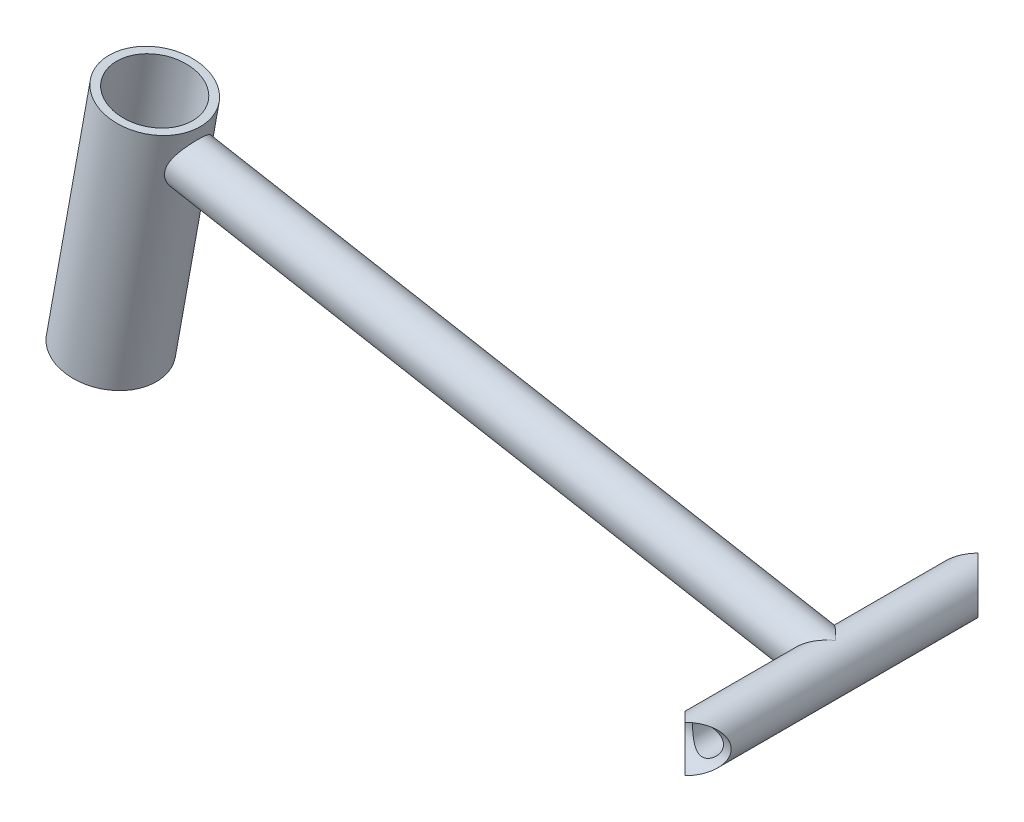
from build123d import *

# Parameters (mm, degrees)
ESQUISSE3_R             = 15
ENL_V_MAT_EXTRU_1_DEPTH = 20
ESQUISSE4_R             = 15
ESQUISSE4_R_2           = 10
EXTRUSION1_DEPTH        = 95
ESQUISSE6_W             = 40
ESQUISSE6_H             = 15
ESQUISSE7_W             = 92.92613999
ESQUISSE7_H             = 15


with BuildPart() as part:
    # Esquisse1 → R_vol.-Mince2 (revolve)
    with BuildSketch(Plane.XY, mode=Mode.PRIVATE) as r_vol_mince2_sk:
        Polygon((-440.165129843, 94.761059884), (2.666666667, 14.761059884), (2.133333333, 11.808847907), (-440.698463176, 91.808847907), align=None)
    revolve(r_vol_mince2_sk.sketch.rotate(Axis((-442.83179651, 80, 0), (0.9840706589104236, -0.1777777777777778, 0)), 180), axis=Axis((-442.83179651, 80, 0), (0.9840706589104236, -0.1777777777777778, 0)))

    # Esquisse2 → Enl_vement de mati_re-R_volution1 (revolve, cut)
    with BuildSketch(Plane.XY):
        Polygon((-409.220787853, 97.300291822), (-417.931898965, 49.080829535), (-447.454018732, 54.414162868), (-438.742907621, 102.633625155), align=None)
    revolve(axis=Axis((-426.215352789, 171.978620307, 0), (-0.1777777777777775, -0.9840706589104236, 0)), mode=Mode.SUBTRACT)

    # Esquisse3 → Enl_v. mat.-Extru.1 (cut, symmetric)
    with BuildSketch(Plane.XY):
        Circle(ESQUISSE3_R)
    extrude(amount=ENL_V_MAT_EXTRU_1_DEPTH, both=True, mode=Mode.SUBTRACT)

    # Esquisse4 → Extrusion1 (add, symmetric)
    with BuildSketch(Plane.XY):
        Circle(ESQUISSE4_R)
        Circle(ESQUISSE4_R_2, mode=Mode.SUBTRACT)
    extrude(amount=EXTRUSION1_DEPTH, both=True)

    # Esquisse5 → R_volution1 (revolve)
    with BuildSketch(Plane.XY, mode=Mode.PRIVATE) as r_volution1_sk:
        Polygon((-409.220787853, 97.300291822), (-437.665232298, -60.151013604), (-442.585585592, -59.262124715), (-414.141141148, 98.18918071), align=None)
    revolve(r_volution1_sk.sketch.rotate(Axis((-426.215352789, 171.978620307, 0), (-0.17777777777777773, -0.9840706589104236, 0)), 180), axis=Axis((-426.215352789, 171.978620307, 0), (-0.17777777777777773, -0.9840706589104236, 0)))

    # Esquisse6 → Enl_vement de mati_re-R_volution2 (revolve, cut)
    with BuildSketch(Plane(origin=(0, 0, 0), x_dir=(1, 0, 0), z_dir=(0, 1, 0))):
        with Locations((0, -87.5)):
            Rectangle(ESQUISSE6_W, ESQUISSE6_H)
    revolve(axis=Axis((-258.776649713, 0, 95), (1, 0, 0)), mode=Mode.SUBTRACT)

    # Esquisse7 → Enl_vement de mati_re-R_volution4 (revolve, cut)
    with BuildSketch(Plane(origin=(0, 0, 0), x_dir=(1, 0, 0), z_dir=(0, 1, 0))):
        with Locations((-1.670618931, 87.5)):
            Rectangle(ESQUISSE7_W, ESQUISSE7_H)
    revolve(axis=Axis((-85.158947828, 0, -95), (1, 0, 0)), mode=Mode.SUBTRACT)


solid = part.part
